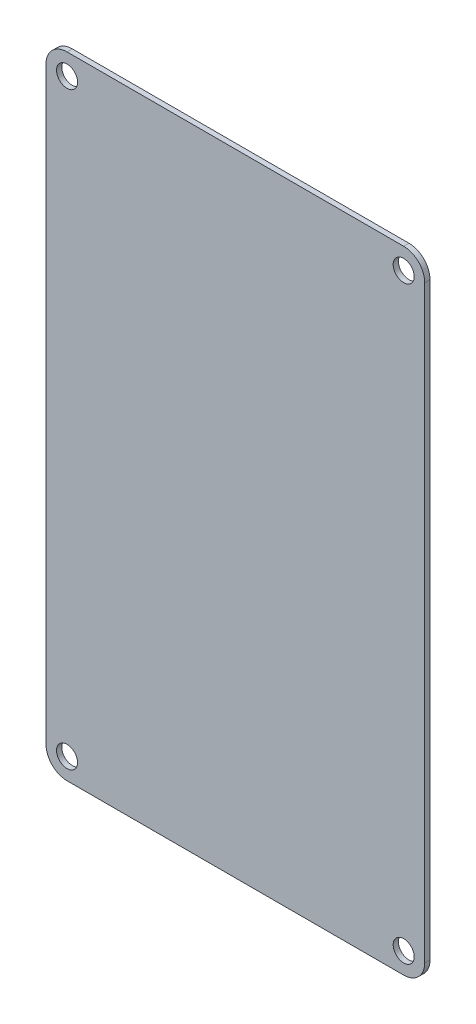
ISO-10303-21;
HEADER;
FILE_DESCRIPTION(('STEP AP214'),'2;1');
FILE_NAME('part.step','',(''),(''),'','','');
FILE_SCHEMA(('AUTOMOTIVE_DESIGN { 1 0 10303 214 1 1 1 1 }'));
ENDSEC;
DATA;
#1=APPLICATION_CONTEXT('core data for automotive mechanical design processes');
#2=APPLICATION_PROTOCOL_DEFINITION('international standard','automotive_design',2000,#1);
#3=PRODUCT_CONTEXT('',#1,'mechanical');
#4=PRODUCT('Part','Part','',(#3));
#5=PRODUCT_RELATED_PRODUCT_CATEGORY('part','',(#4));
#6=PRODUCT_DEFINITION_FORMATION('','',#4);
#7=PRODUCT_DEFINITION_CONTEXT('part definition',#1,'design');
#8=PRODUCT_DEFINITION('design','',#6,#7);
#9=PRODUCT_DEFINITION_SHAPE('','',#8);
#10=(LENGTH_UNIT() NAMED_UNIT(*) SI_UNIT(.MILLI.,.METRE.));
#11=(NAMED_UNIT(*) PLANE_ANGLE_UNIT() SI_UNIT($,.RADIAN.));
#12=(NAMED_UNIT(*) SI_UNIT($,.STERADIAN.) SOLID_ANGLE_UNIT());
#13=UNCERTAINTY_MEASURE_WITH_UNIT(LENGTH_MEASURE(1.E-05),#10,'distance_accuracy_value','');
#14=(GEOMETRIC_REPRESENTATION_CONTEXT(3) GLOBAL_UNCERTAINTY_ASSIGNED_CONTEXT((#13)) GLOBAL_UNIT_ASSIGNED_CONTEXT((#10,
#11,#12)) REPRESENTATION_CONTEXT('',''));
#15=CARTESIAN_POINT('',(0.,0.,0.));
#16=DIRECTION('',(0.,0.,1.));
#17=DIRECTION('',(1.,0.,0.));
#18=AXIS2_PLACEMENT_3D('',#15,#16,#17);
#19=CARTESIAN_POINT('',(-18.72,-31.2,0.5));
#20=DIRECTION('',(0.,0.,1.));
#21=DIRECTION('',(1.,0.,0.));
#22=AXIS2_PLACEMENT_3D('',#19,#20,#21);
#23=PLANE('',#22);
#24=CARTESIAN_POINT('',(16.,-28.,0.5));
#25=DIRECTION('',(0.,0.,-1.));
#26=DIRECTION('',(0.,1.,0.));
#27=AXIS2_PLACEMENT_3D('',#24,#25,#26);
#28=CIRCLE('',#27,1.);
#29=CARTESIAN_POINT('',(16.,-27.,0.5));
#30=VERTEX_POINT('',#29);
#31=EDGE_CURVE('E137',#30,#30,#28,.T.);
#32=ORIENTED_EDGE('',*,*,#31,.T.);
#33=EDGE_LOOP('',(#32));
#34=FACE_BOUND('',#33,.T.);
#35=CARTESIAN_POINT('',(-16.,-28.,0.5));
#36=DIRECTION('',(0.,0.,-1.));
#37=DIRECTION('',(0.,1.,0.));
#38=AXIS2_PLACEMENT_3D('',#35,#36,#37);
#39=CIRCLE('',#38,1.);
#40=CARTESIAN_POINT('',(-16.,-27.,0.5));
#41=VERTEX_POINT('',#40);
#42=EDGE_CURVE('E140',#41,#41,#39,.T.);
#43=ORIENTED_EDGE('',*,*,#42,.T.);
#44=EDGE_LOOP('',(#43));
#45=FACE_BOUND('',#44,.T.);
#46=CARTESIAN_POINT('',(16.,28.,0.5));
#47=DIRECTION('',(0.,0.,-1.));
#48=DIRECTION('',(0.,1.,0.));
#49=AXIS2_PLACEMENT_3D('',#46,#47,#48);
#50=CIRCLE('',#49,1.);
#51=CARTESIAN_POINT('',(16.,29.,0.5));
#52=VERTEX_POINT('',#51);
#53=EDGE_CURVE('E98',#52,#52,#50,.T.);
#54=ORIENTED_EDGE('',*,*,#53,.T.);
#55=EDGE_LOOP('',(#54));
#56=FACE_BOUND('',#55,.T.);
#57=CARTESIAN_POINT('',(-16.,28.,0.5));
#58=DIRECTION('',(0.,0.,-1.));
#59=DIRECTION('',(0.,1.,0.));
#60=AXIS2_PLACEMENT_3D('',#57,#58,#59);
#61=CIRCLE('',#60,1.);
#62=CARTESIAN_POINT('',(-16.,29.,0.5));
#63=VERTEX_POINT('',#62);
#64=EDGE_CURVE('E95',#63,#63,#61,.T.);
#65=ORIENTED_EDGE('',*,*,#64,.T.);
#66=EDGE_LOOP('',(#65));
#67=FACE_BOUND('',#66,.T.);
#68=CARTESIAN_POINT('',(-16.,28.,0.5));
#69=DIRECTION('',(0.,0.,-1.));
#70=DIRECTION('',(0.,1.,0.));
#71=AXIS2_PLACEMENT_3D('',#68,#69,#70);
#72=CIRCLE('',#71,2.);
#73=CARTESIAN_POINT('',(-16.,30.,0.5));
#74=VERTEX_POINT('',#73);
#75=CARTESIAN_POINT('',(-18.,28.,0.5));
#76=VERTEX_POINT('',#75);
#77=EDGE_CURVE('E147',#74,#76,#72,.F.);
#78=ORIENTED_EDGE('',*,*,#77,.T.);
#79=DIRECTION('',(0.,1.,0.));
#80=VECTOR('',#79,1.);
#81=CARTESIAN_POINT('',(-18.,0.,0.5));
#82=LINE('',#81,#80);
#83=CARTESIAN_POINT('',(-18.,-28.,0.5));
#84=VERTEX_POINT('',#83);
#85=EDGE_CURVE('E108',#76,#84,#82,.F.);
#86=ORIENTED_EDGE('',*,*,#85,.T.);
#87=CARTESIAN_POINT('',(-16.,-28.,0.5));
#88=DIRECTION('',(0.,0.,-1.));
#89=DIRECTION('',(-1.,0.,0.));
#90=AXIS2_PLACEMENT_3D('',#87,#88,#89);
#91=CIRCLE('',#90,2.);
#92=CARTESIAN_POINT('',(-16.,-30.,0.5));
#93=VERTEX_POINT('',#92);
#94=EDGE_CURVE('E146',#84,#93,#91,.F.);
#95=ORIENTED_EDGE('',*,*,#94,.T.);
#96=DIRECTION('',(-1.,0.,0.));
#97=VECTOR('',#96,1.);
#98=CARTESIAN_POINT('',(0.,-30.,0.5));
#99=LINE('',#98,#97);
#100=CARTESIAN_POINT('',(16.,-30.,0.5));
#101=VERTEX_POINT('',#100);
#102=EDGE_CURVE('E104',#93,#101,#99,.F.);
#103=ORIENTED_EDGE('',*,*,#102,.T.);
#104=CARTESIAN_POINT('',(16.,-28.,0.5));
#105=DIRECTION('',(0.,0.,-1.));
#106=DIRECTION('',(0.,1.,0.));
#107=AXIS2_PLACEMENT_3D('',#104,#105,#106);
#108=CIRCLE('',#107,2.);
#109=CARTESIAN_POINT('',(18.,-28.,0.5));
#110=VERTEX_POINT('',#109);
#111=EDGE_CURVE('E92',#101,#110,#108,.F.);
#112=ORIENTED_EDGE('',*,*,#111,.T.);
#113=DIRECTION('',(0.,-1.,0.));
#114=VECTOR('',#113,1.);
#115=CARTESIAN_POINT('',(18.,0.,0.5));
#116=LINE('',#115,#114);
#117=CARTESIAN_POINT('',(18.,28.,0.5));
#118=VERTEX_POINT('',#117);
#119=EDGE_CURVE('E90',#110,#118,#116,.F.);
#120=ORIENTED_EDGE('',*,*,#119,.T.);
#121=CARTESIAN_POINT('',(16.,28.,0.5));
#122=DIRECTION('',(0.,0.,-1.));
#123=DIRECTION('',(-1.,0.,0.));
#124=AXIS2_PLACEMENT_3D('',#121,#122,#123);
#125=CIRCLE('',#124,2.);
#126=CARTESIAN_POINT('',(16.,30.,0.5));
#127=VERTEX_POINT('',#126);
#128=EDGE_CURVE('E20',#118,#127,#125,.F.);
#129=ORIENTED_EDGE('',*,*,#128,.T.);
#130=DIRECTION('',(1.,0.,0.));
#131=VECTOR('',#130,1.);
#132=CARTESIAN_POINT('',(0.,30.,0.5));
#133=LINE('',#132,#131);
#134=EDGE_CURVE('E112',#127,#74,#133,.F.);
#135=ORIENTED_EDGE('',*,*,#134,.T.);
#136=EDGE_LOOP('',(#78,#86,#95,#103,#112,#120,#129,#135));
#137=FACE_BOUND('',#136,.T.);
#138=ADVANCED_FACE('F16',(#34,#45,#56,#67,#137),#23,.T.);
#139=CARTESIAN_POINT('',(16.,28.,0.5));
#140=DIRECTION('',(0.,0.,-1.));
#141=DIRECTION('',(-1.,0.,0.));
#142=AXIS2_PLACEMENT_3D('',#139,#140,#141);
#143=CYLINDRICAL_SURFACE('',#142,2.);
#144=DIRECTION('',(0.,0.,1.));
#145=VECTOR('',#144,1.);
#146=CARTESIAN_POINT('',(18.,28.,0.249999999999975));
#147=LINE('',#146,#145);
#148=CARTESIAN_POINT('',(18.,28.,0.));
#149=VERTEX_POINT('',#148);
#150=EDGE_CURVE('E84',#118,#149,#147,.F.);
#151=ORIENTED_EDGE('',*,*,#150,.T.);
#152=CARTESIAN_POINT('',(16.,28.,0.));
#153=DIRECTION('',(0.,0.,-1.));
#154=DIRECTION('',(-1.,0.,0.));
#155=AXIS2_PLACEMENT_3D('',#152,#153,#154);
#156=CIRCLE('',#155,2.);
#157=CARTESIAN_POINT('',(16.,30.,0.));
#158=VERTEX_POINT('',#157);
#159=EDGE_CURVE('E135',#149,#158,#156,.F.);
#160=ORIENTED_EDGE('',*,*,#159,.T.);
#161=DIRECTION('',(0.,0.,-1.));
#162=VECTOR('',#161,1.);
#163=CARTESIAN_POINT('',(16.,30.,0.249999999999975));
#164=LINE('',#163,#162);
#165=EDGE_CURVE('E85',#158,#127,#164,.F.);
#166=ORIENTED_EDGE('',*,*,#165,.T.);
#167=ORIENTED_EDGE('',*,*,#128,.F.);
#168=EDGE_LOOP('',(#151,#160,#166,#167));
#169=FACE_BOUND('',#168,.T.);
#170=ADVANCED_FACE('F82',(#169),#143,.T.);
#171=CARTESIAN_POINT('',(16.64,30.,-0.09236227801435));
#172=DIRECTION('',(0.,1.,0.));
#173=DIRECTION('',(-1.,0.,0.));
#174=AXIS2_PLACEMENT_3D('',#171,#172,#173);
#175=PLANE('',#174);
#176=DIRECTION('',(0.,0.,1.));
#177=VECTOR('',#176,1.);
#178=CARTESIAN_POINT('',(-16.,30.,0.249999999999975));
#179=LINE('',#178,#177);
#180=CARTESIAN_POINT('',(-16.,30.,0.));
#181=VERTEX_POINT('',#180);
#182=EDGE_CURVE('E113',#181,#74,#179,.T.);
#183=ORIENTED_EDGE('',*,*,#182,.T.);
#184=ORIENTED_EDGE('',*,*,#134,.F.);
#185=ORIENTED_EDGE('',*,*,#165,.F.);
#186=DIRECTION('',(-1.,0.,0.));
#187=VECTOR('',#186,1.);
#188=CARTESIAN_POINT('',(0.,30.,0.));
#189=LINE('',#188,#187);
#190=EDGE_CURVE('E134',#158,#181,#189,.T.);
#191=ORIENTED_EDGE('',*,*,#190,.T.);
#192=EDGE_LOOP('',(#183,#184,#185,#191));
#193=FACE_BOUND('',#192,.T.);
#194=ADVANCED_FACE('F185',(#193),#175,.T.);
#195=CARTESIAN_POINT('',(-16.,28.,0.5));
#196=DIRECTION('',(0.,0.,-1.));
#197=DIRECTION('',(0.,1.,0.));
#198=AXIS2_PLACEMENT_3D('',#195,#196,#197);
#199=CYLINDRICAL_SURFACE('',#198,2.);
#200=ORIENTED_EDGE('',*,*,#182,.F.);
#201=CARTESIAN_POINT('',(-16.,28.,0.));
#202=DIRECTION('',(0.,0.,-1.));
#203=DIRECTION('',(0.,1.,0.));
#204=AXIS2_PLACEMENT_3D('',#201,#202,#203);
#205=CIRCLE('',#204,2.);
#206=CARTESIAN_POINT('',(-18.,28.,0.));
#207=VERTEX_POINT('',#206);
#208=EDGE_CURVE('E131',#181,#207,#205,.F.);
#209=ORIENTED_EDGE('',*,*,#208,.T.);
#210=DIRECTION('',(0.,0.,-1.));
#211=VECTOR('',#210,1.);
#212=CARTESIAN_POINT('',(-18.,28.,0.249999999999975));
#213=LINE('',#212,#211);
#214=EDGE_CURVE('E111',#207,#76,#213,.F.);
#215=ORIENTED_EDGE('',*,*,#214,.T.);
#216=ORIENTED_EDGE('',*,*,#77,.F.);
#217=EDGE_LOOP('',(#200,#209,#215,#216));
#218=FACE_BOUND('',#217,.T.);
#219=ADVANCED_FACE('F183',(#218),#199,.T.);
#220=CARTESIAN_POINT('',(-18.,29.12,-0.09236227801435));
#221=DIRECTION('',(-1.,0.,0.));
#222=DIRECTION('',(0.,-1.,0.));
#223=AXIS2_PLACEMENT_3D('',#220,#221,#222);
#224=PLANE('',#223);
#225=DIRECTION('',(0.,0.,1.));
#226=VECTOR('',#225,1.);
#227=CARTESIAN_POINT('',(-18.,-28.,0.249999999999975));
#228=LINE('',#227,#226);
#229=CARTESIAN_POINT('',(-18.,-28.,0.));
#230=VERTEX_POINT('',#229);
#231=EDGE_CURVE('E110',#230,#84,#228,.T.);
#232=ORIENTED_EDGE('',*,*,#231,.T.);
#233=ORIENTED_EDGE('',*,*,#85,.F.);
#234=ORIENTED_EDGE('',*,*,#214,.F.);
#235=DIRECTION('',(0.,-1.,0.));
#236=VECTOR('',#235,1.);
#237=CARTESIAN_POINT('',(-18.,0.,0.));
#238=LINE('',#237,#236);
#239=EDGE_CURVE('E130',#207,#230,#238,.T.);
#240=ORIENTED_EDGE('',*,*,#239,.T.);
#241=EDGE_LOOP('',(#232,#233,#234,#240));
#242=FACE_BOUND('',#241,.T.);
#243=ADVANCED_FACE('F179',(#242),#224,.T.);
#244=CARTESIAN_POINT('',(-16.,-28.,0.5));
#245=DIRECTION('',(0.,0.,-1.));
#246=DIRECTION('',(-1.,0.,0.));
#247=AXIS2_PLACEMENT_3D('',#244,#245,#246);
#248=CYLINDRICAL_SURFACE('',#247,2.);
#249=ORIENTED_EDGE('',*,*,#231,.F.);
#250=CARTESIAN_POINT('',(-16.,-28.,0.));
#251=DIRECTION('',(0.,0.,-1.));
#252=DIRECTION('',(-1.,0.,0.));
#253=AXIS2_PLACEMENT_3D('',#250,#251,#252);
#254=CIRCLE('',#253,2.);
#255=CARTESIAN_POINT('',(-16.,-30.,0.));
#256=VERTEX_POINT('',#255);
#257=EDGE_CURVE('E127',#230,#256,#254,.F.);
#258=ORIENTED_EDGE('',*,*,#257,.T.);
#259=DIRECTION('',(0.,0.,-1.));
#260=VECTOR('',#259,1.);
#261=CARTESIAN_POINT('',(-16.,-30.,0.249999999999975));
#262=LINE('',#261,#260);
#263=EDGE_CURVE('E107',#256,#93,#262,.F.);
#264=ORIENTED_EDGE('',*,*,#263,.T.);
#265=ORIENTED_EDGE('',*,*,#94,.F.);
#266=EDGE_LOOP('',(#249,#258,#264,#265));
#267=FACE_BOUND('',#266,.T.);
#268=ADVANCED_FACE('F176',(#267),#248,.T.);
#269=CARTESIAN_POINT('',(-16.64,-30.,-0.09236227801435));
#270=DIRECTION('',(0.,-1.,0.));
#271=DIRECTION('',(1.,0.,0.));
#272=AXIS2_PLACEMENT_3D('',#269,#270,#271);
#273=PLANE('',#272);
#274=ORIENTED_EDGE('',*,*,#263,.F.);
#275=DIRECTION('',(1.,0.,0.));
#276=VECTOR('',#275,1.);
#277=CARTESIAN_POINT('',(0.,-30.,0.));
#278=LINE('',#277,#276);
#279=CARTESIAN_POINT('',(16.,-30.,0.));
#280=VERTEX_POINT('',#279);
#281=EDGE_CURVE('E126',#256,#280,#278,.T.);
#282=ORIENTED_EDGE('',*,*,#281,.T.);
#283=DIRECTION('',(0.,0.,1.));
#284=VECTOR('',#283,1.);
#285=CARTESIAN_POINT('',(16.,-30.,0.249999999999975));
#286=LINE('',#285,#284);
#287=EDGE_CURVE('E106',#280,#101,#286,.T.);
#288=ORIENTED_EDGE('',*,*,#287,.T.);
#289=ORIENTED_EDGE('',*,*,#102,.F.);
#290=EDGE_LOOP('',(#274,#282,#288,#289));
#291=FACE_BOUND('',#290,.T.);
#292=ADVANCED_FACE('F169',(#291),#273,.T.);
#293=CARTESIAN_POINT('',(16.,-28.,0.5));
#294=DIRECTION('',(0.,0.,-1.));
#295=DIRECTION('',(0.,1.,0.));
#296=AXIS2_PLACEMENT_3D('',#293,#294,#295);
#297=CYLINDRICAL_SURFACE('',#296,2.);
#298=ORIENTED_EDGE('',*,*,#287,.F.);
#299=CARTESIAN_POINT('',(16.,-28.,0.));
#300=DIRECTION('',(0.,0.,-1.));
#301=DIRECTION('',(0.,1.,0.));
#302=AXIS2_PLACEMENT_3D('',#299,#300,#301);
#303=CIRCLE('',#302,2.);
#304=CARTESIAN_POINT('',(18.,-28.,0.));
#305=VERTEX_POINT('',#304);
#306=EDGE_CURVE('E123',#280,#305,#303,.F.);
#307=ORIENTED_EDGE('',*,*,#306,.T.);
#308=DIRECTION('',(0.,0.,-1.));
#309=VECTOR('',#308,1.);
#310=CARTESIAN_POINT('',(18.,-28.,0.249999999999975));
#311=LINE('',#310,#309);
#312=EDGE_CURVE('E35',#305,#110,#311,.F.);
#313=ORIENTED_EDGE('',*,*,#312,.T.);
#314=ORIENTED_EDGE('',*,*,#111,.F.);
#315=EDGE_LOOP('',(#298,#307,#313,#314));
#316=FACE_BOUND('',#315,.T.);
#317=ADVANCED_FACE('F224',(#316),#297,.T.);
#318=CARTESIAN_POINT('',(18.,-29.12,-0.09236227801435));
#319=DIRECTION('',(1.,0.,0.));
#320=DIRECTION('',(0.,1.,0.));
#321=AXIS2_PLACEMENT_3D('',#318,#319,#320);
#322=PLANE('',#321);
#323=ORIENTED_EDGE('',*,*,#312,.F.);
#324=DIRECTION('',(0.,1.,0.));
#325=VECTOR('',#324,1.);
#326=CARTESIAN_POINT('',(18.,0.,0.));
#327=LINE('',#326,#325);
#328=EDGE_CURVE('E91',#305,#149,#327,.T.);
#329=ORIENTED_EDGE('',*,*,#328,.T.);
#330=ORIENTED_EDGE('',*,*,#150,.F.);
#331=ORIENTED_EDGE('',*,*,#119,.F.);
#332=EDGE_LOOP('',(#323,#329,#330,#331));
#333=FACE_BOUND('',#332,.T.);
#334=ADVANCED_FACE('F89',(#333),#322,.T.);
#335=CARTESIAN_POINT('',(-16.,28.,0.5));
#336=DIRECTION('',(0.,0.,-1.));
#337=DIRECTION('',(0.,1.,0.));
#338=AXIS2_PLACEMENT_3D('',#335,#336,#337);
#339=CYLINDRICAL_SURFACE('',#338,1.);
#340=ORIENTED_EDGE('',*,*,#64,.F.);
#341=EDGE_LOOP('',(#340));
#342=FACE_BOUND('',#341,.T.);
#343=CARTESIAN_POINT('',(-16.,28.,0.));
#344=DIRECTION('',(0.,0.,-1.));
#345=DIRECTION('',(0.,1.,0.));
#346=AXIS2_PLACEMENT_3D('',#343,#344,#345);
#347=CIRCLE('',#346,1.);
#348=CARTESIAN_POINT('',(-16.,29.,0.));
#349=VERTEX_POINT('',#348);
#350=EDGE_CURVE('E120',#349,#349,#347,.T.);
#351=ORIENTED_EDGE('',*,*,#350,.T.);
#352=EDGE_LOOP('',(#351));
#353=FACE_BOUND('',#352,.T.);
#354=ADVANCED_FACE('F213',(#342,#353),#339,.F.);
#355=CARTESIAN_POINT('',(16.,28.,0.5));
#356=DIRECTION('',(0.,0.,-1.));
#357=DIRECTION('',(0.,1.,0.));
#358=AXIS2_PLACEMENT_3D('',#355,#356,#357);
#359=CYLINDRICAL_SURFACE('',#358,1.);
#360=ORIENTED_EDGE('',*,*,#53,.F.);
#361=EDGE_LOOP('',(#360));
#362=FACE_BOUND('',#361,.T.);
#363=CARTESIAN_POINT('',(16.,28.,0.));
#364=DIRECTION('',(0.,0.,-1.));
#365=DIRECTION('',(0.,1.,0.));
#366=AXIS2_PLACEMENT_3D('',#363,#364,#365);
#367=CIRCLE('',#366,1.);
#368=CARTESIAN_POINT('',(16.,29.,0.));
#369=VERTEX_POINT('',#368);
#370=EDGE_CURVE('E117',#369,#369,#367,.T.);
#371=ORIENTED_EDGE('',*,*,#370,.T.);
#372=EDGE_LOOP('',(#371));
#373=FACE_BOUND('',#372,.T.);
#374=ADVANCED_FACE('F215',(#362,#373),#359,.F.);
#375=CARTESIAN_POINT('',(-16.,-28.,0.5));
#376=DIRECTION('',(0.,0.,-1.));
#377=DIRECTION('',(0.,1.,0.));
#378=AXIS2_PLACEMENT_3D('',#375,#376,#377);
#379=CYLINDRICAL_SURFACE('',#378,1.);
#380=ORIENTED_EDGE('',*,*,#42,.F.);
#381=EDGE_LOOP('',(#380));
#382=FACE_BOUND('',#381,.T.);
#383=CARTESIAN_POINT('',(-16.,-28.,0.));
#384=DIRECTION('',(0.,0.,-1.));
#385=DIRECTION('',(0.,1.,0.));
#386=AXIS2_PLACEMENT_3D('',#383,#384,#385);
#387=CIRCLE('',#386,1.);
#388=CARTESIAN_POINT('',(-16.,-27.,0.));
#389=VERTEX_POINT('',#388);
#390=EDGE_CURVE('E26',#389,#389,#387,.T.);
#391=ORIENTED_EDGE('',*,*,#390,.T.);
#392=EDGE_LOOP('',(#391));
#393=FACE_BOUND('',#392,.T.);
#394=ADVANCED_FACE('F202',(#382,#393),#379,.F.);
#395=CARTESIAN_POINT('',(16.,-28.,0.5));
#396=DIRECTION('',(0.,0.,-1.));
#397=DIRECTION('',(0.,1.,0.));
#398=AXIS2_PLACEMENT_3D('',#395,#396,#397);
#399=CYLINDRICAL_SURFACE('',#398,1.);
#400=ORIENTED_EDGE('',*,*,#31,.F.);
#401=EDGE_LOOP('',(#400));
#402=FACE_BOUND('',#401,.T.);
#403=CARTESIAN_POINT('',(16.,-28.,0.));
#404=DIRECTION('',(0.,0.,-1.));
#405=DIRECTION('',(0.,1.,0.));
#406=AXIS2_PLACEMENT_3D('',#403,#404,#405);
#407=CIRCLE('',#406,1.);
#408=CARTESIAN_POINT('',(16.,-27.,0.));
#409=VERTEX_POINT('',#408);
#410=EDGE_CURVE('E11',#409,#409,#407,.T.);
#411=ORIENTED_EDGE('',*,*,#410,.T.);
#412=EDGE_LOOP('',(#411));
#413=FACE_BOUND('',#412,.T.);
#414=ADVANCED_FACE('F197',(#402,#413),#399,.F.);
#415=CARTESIAN_POINT('',(-18.72,-31.2,0.));
#416=DIRECTION('',(0.,0.,1.));
#417=DIRECTION('',(1.,0.,0.));
#418=AXIS2_PLACEMENT_3D('',#415,#416,#417);
#419=PLANE('',#418);
#420=ORIENTED_EDGE('',*,*,#410,.F.);
#421=EDGE_LOOP('',(#420));
#422=FACE_BOUND('',#421,.T.);
#423=ORIENTED_EDGE('',*,*,#390,.F.);
#424=EDGE_LOOP('',(#423));
#425=FACE_BOUND('',#424,.T.);
#426=ORIENTED_EDGE('',*,*,#370,.F.);
#427=EDGE_LOOP('',(#426));
#428=FACE_BOUND('',#427,.T.);
#429=ORIENTED_EDGE('',*,*,#350,.F.);
#430=EDGE_LOOP('',(#429));
#431=FACE_BOUND('',#430,.T.);
#432=ORIENTED_EDGE('',*,*,#306,.F.);
#433=ORIENTED_EDGE('',*,*,#281,.F.);
#434=ORIENTED_EDGE('',*,*,#257,.F.);
#435=ORIENTED_EDGE('',*,*,#239,.F.);
#436=ORIENTED_EDGE('',*,*,#208,.F.);
#437=ORIENTED_EDGE('',*,*,#190,.F.);
#438=ORIENTED_EDGE('',*,*,#159,.F.);
#439=ORIENTED_EDGE('',*,*,#328,.F.);
#440=EDGE_LOOP('',(#432,#433,#434,#435,#436,#437,#438,#439));
#441=FACE_BOUND('',#440,.T.);
#442=ADVANCED_FACE('F18',(#422,#425,#428,#431,#441),#419,.F.);
#443=CLOSED_SHELL('',(#138,#170,#194,#219,#243,#268,#292,#317,#334,#354,#374,#394,#414,#442));
#444=MANIFOLD_SOLID_BREP('B1',#443);
#445=ADVANCED_BREP_SHAPE_REPRESENTATION('',(#18,#444),#14);
#446=SHAPE_DEFINITION_REPRESENTATION(#9,#445);
ENDSEC;
END-ISO-10303-21;
